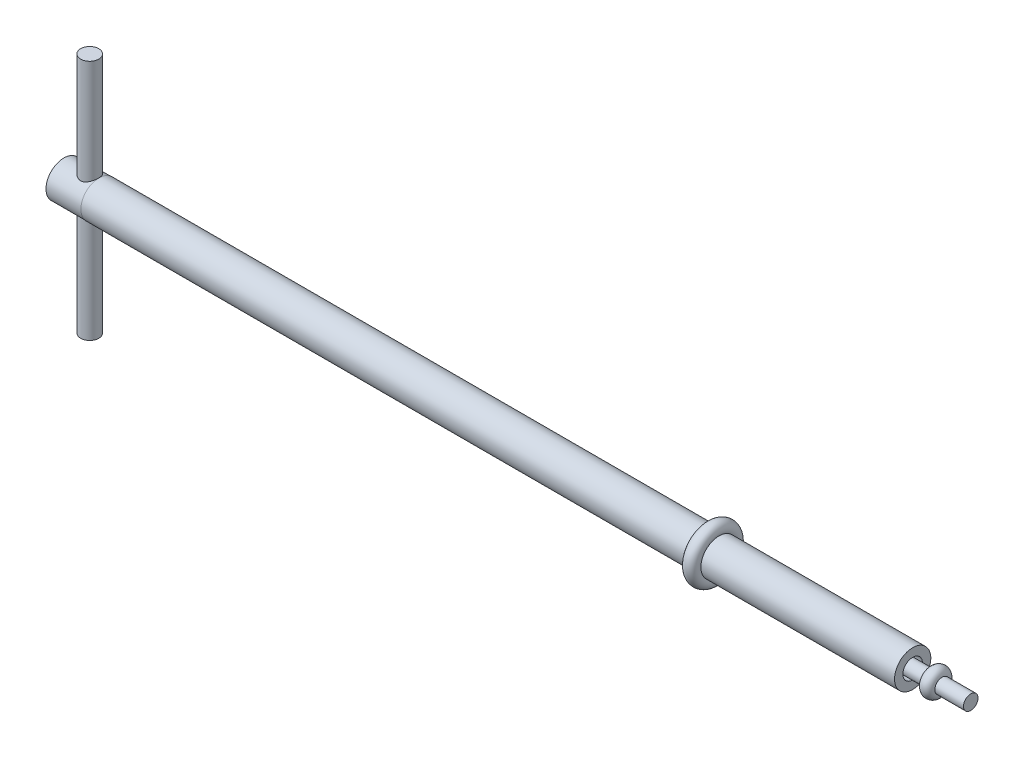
ISO-10303-21;
HEADER;
FILE_DESCRIPTION(('STEP AP214'),'2;1');
FILE_NAME('part.step','',(''),(''),'','','');
FILE_SCHEMA(('AUTOMOTIVE_DESIGN { 1 0 10303 214 1 1 1 1 }'));
ENDSEC;
DATA;
#1=APPLICATION_CONTEXT('core data for automotive mechanical design processes');
#2=APPLICATION_PROTOCOL_DEFINITION('international standard','automotive_design',2000,#1);
#3=PRODUCT_CONTEXT('',#1,'mechanical');
#4=PRODUCT('Part','Part','',(#3));
#5=PRODUCT_RELATED_PRODUCT_CATEGORY('part','',(#4));
#6=PRODUCT_DEFINITION_FORMATION('','',#4);
#7=PRODUCT_DEFINITION_CONTEXT('part definition',#1,'design');
#8=PRODUCT_DEFINITION('design','',#6,#7);
#9=PRODUCT_DEFINITION_SHAPE('','',#8);
#10=(LENGTH_UNIT() NAMED_UNIT(*) SI_UNIT(.MILLI.,.METRE.));
#11=(NAMED_UNIT(*) PLANE_ANGLE_UNIT() SI_UNIT($,.RADIAN.));
#12=(NAMED_UNIT(*) SI_UNIT($,.STERADIAN.) SOLID_ANGLE_UNIT());
#13=UNCERTAINTY_MEASURE_WITH_UNIT(LENGTH_MEASURE(1.E-05),#10,'distance_accuracy_value','');
#14=(GEOMETRIC_REPRESENTATION_CONTEXT(3) GLOBAL_UNCERTAINTY_ASSIGNED_CONTEXT((#13)) GLOBAL_UNIT_ASSIGNED_CONTEXT((#10,
#11,#12)) REPRESENTATION_CONTEXT('',''));
#15=CARTESIAN_POINT('',(0.,0.,0.));
#16=DIRECTION('',(0.,0.,1.));
#17=DIRECTION('',(1.,0.,0.));
#18=AXIS2_PLACEMENT_3D('',#15,#16,#17);
#19=CARTESIAN_POINT('',(0.,0.,0.));
#20=DIRECTION('',(1.,0.,0.));
#21=DIRECTION('',(0.,0.,-1.));
#22=AXIS2_PLACEMENT_3D('',#19,#20,#21);
#23=PLANE('',#22);
#24=CARTESIAN_POINT('',(0.,0.,0.));
#25=DIRECTION('',(-1.,0.,0.));
#26=DIRECTION('',(0.,0.,1.));
#27=AXIS2_PLACEMENT_3D('',#24,#25,#26);
#28=CIRCLE('',#27,2.96848884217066);
#29=CARTESIAN_POINT('',(0.,0.,2.96848884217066));
#30=VERTEX_POINT('',#29);
#31=EDGE_CURVE('E9',#30,#30,#28,.T.);
#32=ORIENTED_EDGE('',*,*,#31,.T.);
#33=EDGE_LOOP('',(#32));
#34=FACE_BOUND('',#33,.T.);
#35=ADVANCED_FACE('F14',(#34),#23,.F.);
#36=CARTESIAN_POINT('',(0.,0.,0.));
#37=DIRECTION('',(-1.,0.,0.));
#38=DIRECTION('',(0.,0.,1.));
#39=AXIS2_PLACEMENT_3D('',#36,#37,#38);
#40=CYLINDRICAL_SURFACE('',#39,2.96848884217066);
#41=CARTESIAN_POINT('',(4.2661907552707,-2.56162565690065,1.5));
#42=CARTESIAN_POINT('',(4.34422264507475,-2.56163267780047,1.4999944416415));
#43=CARTESIAN_POINT('',(4.42235011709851,-2.5652455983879,1.49387019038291));
#44=CARTESIAN_POINT('',(4.57619660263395,-2.57917019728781,1.46969018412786));
#45=CARTESIAN_POINT('',(4.65191032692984,-2.58949565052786,1.45160989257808));
#46=CARTESIAN_POINT('',(4.7984121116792,-2.61534051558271,1.40450365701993));
#47=CARTESIAN_POINT('',(4.86922439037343,-2.63083180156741,1.37553687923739));
#48=CARTESIAN_POINT('',(5.00496574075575,-2.66521903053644,1.3076607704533));
#49=CARTESIAN_POINT('',(5.06989438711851,-2.68411521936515,1.26875072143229));
#50=CARTESIAN_POINT('',(5.1980701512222,-2.72512943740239,1.17824574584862));
#51=CARTESIAN_POINT('',(5.26071360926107,-2.74738478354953,1.12585775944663));
#52=CARTESIAN_POINT('',(5.37679616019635,-2.79150219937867,1.01153200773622));
#53=CARTESIAN_POINT('',(5.43023057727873,-2.81336406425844,0.949589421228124));
#54=CARTESIAN_POINT('',(5.53000027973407,-2.85604040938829,0.812675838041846));
#55=CARTESIAN_POINT('',(5.57558830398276,-2.87667768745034,0.737099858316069));
#56=CARTESIAN_POINT('',(5.65312694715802,-2.91278858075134,0.57811281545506));
#57=CARTESIAN_POINT('',(5.68508635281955,-2.92826552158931,0.494706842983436));
#58=CARTESIAN_POINT('',(5.73205409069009,-2.95132082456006,0.328826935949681));
#59=CARTESIAN_POINT('',(5.74812234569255,-2.95939000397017,0.246722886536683));
#60=CARTESIAN_POINT('',(5.76634693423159,-2.96855664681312,0.0806187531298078));
#61=CARTESIAN_POINT('',(5.76851189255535,-2.96965843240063,-0.00338012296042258));
#62=CARTESIAN_POINT('',(5.75926674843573,-2.96499461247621,-0.162900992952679));
#63=CARTESIAN_POINT('',(5.74904466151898,-2.95982995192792,-0.238513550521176));
#64=CARTESIAN_POINT('',(5.71744812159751,-2.94412744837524,-0.386779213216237));
#65=CARTESIAN_POINT('',(5.69607283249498,-2.93358920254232,-0.459432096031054));
#66=CARTESIAN_POINT('',(5.64265046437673,-2.90792243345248,-0.600967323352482));
#67=CARTESIAN_POINT('',(5.6104622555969,-2.89273345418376,-0.669784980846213));
#68=CARTESIAN_POINT('',(5.53652935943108,-2.85912624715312,-0.801205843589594));
#69=CARTESIAN_POINT('',(5.49478127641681,-2.84070687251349,-0.863806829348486));
#70=CARTESIAN_POINT('',(5.39831355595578,-2.80027310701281,-0.987431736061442));
#71=CARTESIAN_POINT('',(5.34273339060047,-2.77808334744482,-1.04772730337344));
#72=CARTESIAN_POINT('',(5.22247589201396,-2.73373058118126,-1.15853905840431));
#73=CARTESIAN_POINT('',(5.15779137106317,-2.711567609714,-1.20904744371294));
#74=CARTESIAN_POINT('',(5.01595350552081,-2.66818702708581,-1.30211863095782));
#75=CARTESIAN_POINT('',(4.93825943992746,-2.64712790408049,-1.34393869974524));
#76=CARTESIAN_POINT('',(4.77563373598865,-2.61059724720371,-1.41360191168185));
#77=CARTESIAN_POINT('',(4.69070988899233,-2.59511979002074,-1.44145988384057));
#78=CARTESIAN_POINT('',(4.52314660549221,-2.5732516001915,-1.48012245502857));
#79=CARTESIAN_POINT('',(4.44086504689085,-2.5662346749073,-1.4921098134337));
#80=CARTESIAN_POINT('',(4.27518725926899,-2.56030791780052,-1.50226241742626));
#81=CARTESIAN_POINT('',(4.19179190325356,-2.56139207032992,-1.50043791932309));
#82=CARTESIAN_POINT('',(4.0363004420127,-2.57088003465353,-1.48410429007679));
#83=CARTESIAN_POINT('',(3.96399155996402,-2.57844372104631,-1.47105036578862));
#84=CARTESIAN_POINT('',(3.82273455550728,-2.5987858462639,-1.43480545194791));
#85=CARTESIAN_POINT('',(3.75378756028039,-2.61156602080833,-1.4116110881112));
#86=CARTESIAN_POINT('',(3.61758262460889,-2.64158935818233,-1.35462537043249));
#87=CARTESIAN_POINT('',(3.55054962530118,-2.65901132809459,-1.32039421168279));
#88=CARTESIAN_POINT('',(3.4227891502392,-2.69620279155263,-1.24268708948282));
#89=CARTESIAN_POINT('',(3.36206494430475,-2.71597349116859,-1.19920636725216));
#90=CARTESIAN_POINT('',(3.24042974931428,-2.75870627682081,-1.09766735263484));
#91=CARTESIAN_POINT('',(3.18050972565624,-2.78175048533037,-1.03845113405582));
#92=CARTESIAN_POINT('',(3.07113715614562,-2.82623083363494,-0.910458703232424));
#93=CARTESIAN_POINT('',(3.02168838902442,-2.84766639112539,-0.841679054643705));
#94=CARTESIAN_POINT('',(2.93345142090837,-2.88730330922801,-0.693843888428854));
#95=CARTESIAN_POINT('',(2.89500808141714,-2.90539479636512,-0.61455096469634));
#96=CARTESIAN_POINT('',(2.83239387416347,-2.93546253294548,-0.449446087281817));
#97=CARTESIAN_POINT('',(2.80821021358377,-2.94744426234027,-0.363640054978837));
#98=CARTESIAN_POINT('',(2.77692709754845,-2.96305064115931,-0.196555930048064));
#99=CARTESIAN_POINT('',(2.76844828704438,-2.96734871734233,-0.115598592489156));
#100=CARTESIAN_POINT('',(2.76472481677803,-2.96922900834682,0.046686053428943));
#101=CARTESIAN_POINT('',(2.76947531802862,-2.96681367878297,0.128013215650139));
#102=CARTESIAN_POINT('',(2.79117351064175,-2.95593044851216,0.282881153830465));
#103=CARTESIAN_POINT('',(2.80726716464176,-2.94788661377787,0.356574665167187));
#104=CARTESIAN_POINT('',(2.8500269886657,-2.92696073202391,0.500089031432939));
#105=CARTESIAN_POINT('',(2.87669464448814,-2.91407800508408,0.569909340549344));
#106=CARTESIAN_POINT('',(2.94100554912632,-2.88395591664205,0.70700699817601));
#107=CARTESIAN_POINT('',(2.97906392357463,-2.86655585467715,0.774053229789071));
#108=CARTESIAN_POINT('',(3.06455784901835,-2.82919949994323,0.901081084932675));
#109=CARTESIAN_POINT('',(3.11199768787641,-2.80924203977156,0.961059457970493));
#110=CARTESIAN_POINT('',(3.2204757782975,-2.76635443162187,1.0786621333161));
#111=CARTESIAN_POINT('',(3.28240495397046,-2.74332800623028,1.13543169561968));
#112=CARTESIAN_POINT('',(3.41521608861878,-2.69855126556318,1.23810027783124));
#113=CARTESIAN_POINT('',(3.48610617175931,-2.67680213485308,1.28398932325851));
#114=CARTESIAN_POINT('',(3.63807370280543,-2.63645767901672,1.36496837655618));
#115=CARTESIAN_POINT('',(3.71942032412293,-2.61799889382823,1.39962566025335));
#116=CARTESIAN_POINT('',(3.88798624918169,-2.5880823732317,1.45421765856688));
#117=CARTESIAN_POINT('',(3.97518486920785,-2.57660128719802,1.47420152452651));
#118=CARTESIAN_POINT('',(4.09717142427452,-2.56697512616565,1.49083314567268));
#119=CARTESIAN_POINT('',(4.13084530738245,-2.56497652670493,1.49426512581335));
#120=CARTESIAN_POINT('',(4.1984036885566,-2.56230022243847,1.49884983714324));
#121=CARTESIAN_POINT('',(4.23228820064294,-2.56162260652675,1.50000241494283));
#122=CARTESIAN_POINT('',(4.2661907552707,-2.56162565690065,1.5));
#123=B_SPLINE_CURVE_WITH_KNOTS('',3,(#41,#42,#43,#44,#45,#46,#47,#48,#49,#50,#51,#52,#53,#54,
#55,#56,#57,#58,#59,#60,#61,#62,#63,#64,#65,#66,#67,#68,#69,#70,#71,#72,#73,#74,#75,#76,#77,#78,
#79,#80,#81,#82,#83,#84,#85,#86,#87,#88,#89,#90,#91,#92,#93,#94,#95,#96,#97,#98,#99,#100,#101,
#102,#103,#104,#105,#106,#107,#108,#109,#110,#111,#112,#113,#114,#115,#116,#117,#118,#119,#120,
#121,#122),.UNSPECIFIED.,.T.,.F.,(4,2,2,2,2,2,2,2,2,2,2,2,2,2,2,2,2,2,2,2,2,2,2,2,2,2,2,2,2,2,2,
2,2,2,2,2,2,2,2,2,4),(0.,0.233952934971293,0.468387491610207,0.701565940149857,
0.934761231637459,1.18762397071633,1.44061472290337,1.71111458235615,1.98143977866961,
2.2321892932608,2.48278324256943,2.71113163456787,2.93949714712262,3.17096723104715,
3.40251966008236,3.65630154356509,3.91028491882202,4.18100181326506,4.45143056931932,
4.70029410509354,4.94897285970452,5.16957851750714,5.39025763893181,5.62112511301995,
5.85211165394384,6.11296325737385,6.37390883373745,6.64230820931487,6.91046642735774,
7.15369256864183,7.39682975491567,7.62338321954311,7.84996852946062,8.08610136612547,
8.32234237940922,8.58252752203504,8.8429502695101,9.1124607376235,9.38106425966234,
9.48270307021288,9.58434872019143),.UNSPECIFIED.);
#124=CARTESIAN_POINT('',(4.2661907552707,-2.56162565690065,1.5));
#125=VERTEX_POINT('',#124);
#126=EDGE_CURVE('E17',#125,#125,#123,.T.);
#127=ORIENTED_EDGE('',*,*,#126,.T.);
#128=EDGE_LOOP('',(#127));
#129=FACE_BOUND('',#128,.T.);
#130=CARTESIAN_POINT('',(4.2661907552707,2.56162565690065,1.5));
#131=CARTESIAN_POINT('',(4.18815886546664,2.56163267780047,1.4999944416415));
#132=CARTESIAN_POINT('',(4.11003139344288,2.5652455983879,1.49387019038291));
#133=CARTESIAN_POINT('',(3.95618490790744,2.57917019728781,1.46969018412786));
#134=CARTESIAN_POINT('',(3.88047118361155,2.58949565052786,1.45160989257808));
#135=CARTESIAN_POINT('',(3.73396939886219,2.61534051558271,1.40450365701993));
#136=CARTESIAN_POINT('',(3.66315712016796,2.63083180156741,1.37553687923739));
#137=CARTESIAN_POINT('',(3.52741576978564,2.66521903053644,1.3076607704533));
#138=CARTESIAN_POINT('',(3.46248712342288,2.68411521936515,1.26875072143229));
#139=CARTESIAN_POINT('',(3.33431135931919,2.72512943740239,1.17824574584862));
#140=CARTESIAN_POINT('',(3.27166790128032,2.74738478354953,1.12585775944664));
#141=CARTESIAN_POINT('',(3.15558535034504,2.79150219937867,1.01153200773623));
#142=CARTESIAN_POINT('',(3.10215093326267,2.81336406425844,0.949589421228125));
#143=CARTESIAN_POINT('',(3.00238123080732,2.85604040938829,0.812675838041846));
#144=CARTESIAN_POINT('',(2.95679320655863,2.87667768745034,0.73709985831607));
#145=CARTESIAN_POINT('',(2.87925456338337,2.91278858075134,0.578112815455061));
#146=CARTESIAN_POINT('',(2.84729515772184,2.92826552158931,0.494706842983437));
#147=CARTESIAN_POINT('',(2.8003274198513,2.95132082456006,0.328826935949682));
#148=CARTESIAN_POINT('',(2.78425916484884,2.95939000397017,0.246722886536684));
#149=CARTESIAN_POINT('',(2.7660345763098,2.96855664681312,0.0806187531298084));
#150=CARTESIAN_POINT('',(2.76386961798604,2.96965843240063,-0.00338012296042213));
#151=CARTESIAN_POINT('',(2.77311476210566,2.96499461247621,-0.162900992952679));
#152=CARTESIAN_POINT('',(2.78333684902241,2.95982995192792,-0.238513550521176));
#153=CARTESIAN_POINT('',(2.81493338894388,2.94412744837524,-0.386779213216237));
#154=CARTESIAN_POINT('',(2.83630867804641,2.93358920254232,-0.459432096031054));
#155=CARTESIAN_POINT('',(2.88973104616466,2.90792243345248,-0.600967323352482));
#156=CARTESIAN_POINT('',(2.92191925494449,2.89273345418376,-0.669784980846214));
#157=CARTESIAN_POINT('',(2.99585215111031,2.85912624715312,-0.801205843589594));
#158=CARTESIAN_POINT('',(3.03760023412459,2.84070687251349,-0.863806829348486));
#159=CARTESIAN_POINT('',(3.13406795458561,2.80027310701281,-0.987431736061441));
#160=CARTESIAN_POINT('',(3.18964811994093,2.77808334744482,-1.04772730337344));
#161=CARTESIAN_POINT('',(3.30990561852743,2.73373058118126,-1.15853905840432));
#162=CARTESIAN_POINT('',(3.37459013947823,2.711567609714,-1.20904744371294));
#163=CARTESIAN_POINT('',(3.51642800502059,2.66818702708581,-1.30211863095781));
#164=CARTESIAN_POINT('',(3.59412207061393,2.64712790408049,-1.34393869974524));
#165=CARTESIAN_POINT('',(3.75674777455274,2.6105972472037,-1.41360191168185));
#166=CARTESIAN_POINT('',(3.84167162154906,2.59511979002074,-1.44145988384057));
#167=CARTESIAN_POINT('',(4.00923490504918,2.5732516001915,-1.48012245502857));
#168=CARTESIAN_POINT('',(4.09151646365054,2.5662346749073,-1.4921098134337));
#169=CARTESIAN_POINT('',(4.2571942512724,2.56030791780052,-1.50226241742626));
#170=CARTESIAN_POINT('',(4.34058960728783,2.56139207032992,-1.50043791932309));
#171=CARTESIAN_POINT('',(4.49608106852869,2.57088003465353,-1.48410429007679));
#172=CARTESIAN_POINT('',(4.56838995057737,2.57844372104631,-1.47105036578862));
#173=CARTESIAN_POINT('',(4.70964695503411,2.59878584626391,-1.43480545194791));
#174=CARTESIAN_POINT('',(4.77859395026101,2.61156602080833,-1.4116110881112));
#175=CARTESIAN_POINT('',(4.9147988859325,2.64158935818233,-1.35462537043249));
#176=CARTESIAN_POINT('',(4.98183188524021,2.65901132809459,-1.32039421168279));
#177=CARTESIAN_POINT('',(5.10959236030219,2.69620279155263,-1.24268708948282));
#178=CARTESIAN_POINT('',(5.17031656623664,2.71597349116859,-1.19920636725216));
#179=CARTESIAN_POINT('',(5.29195176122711,2.75870627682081,-1.09766735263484));
#180=CARTESIAN_POINT('',(5.35187178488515,2.78175048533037,-1.03845113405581));
#181=CARTESIAN_POINT('',(5.46124435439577,2.82623083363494,-0.910458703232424));
#182=CARTESIAN_POINT('',(5.51069312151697,2.84766639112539,-0.841679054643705));
#183=CARTESIAN_POINT('',(5.59893008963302,2.88730330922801,-0.693843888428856));
#184=CARTESIAN_POINT('',(5.63737342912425,2.90539479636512,-0.614550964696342));
#185=CARTESIAN_POINT('',(5.69998763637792,2.93546253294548,-0.449446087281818));
#186=CARTESIAN_POINT('',(5.72417129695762,2.94744426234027,-0.363640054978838));
#187=CARTESIAN_POINT('',(5.75545441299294,2.96305064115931,-0.196555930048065));
#188=CARTESIAN_POINT('',(5.76393322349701,2.96734871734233,-0.115598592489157));
#189=CARTESIAN_POINT('',(5.76765669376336,2.96922900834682,0.0466860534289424));
#190=CARTESIAN_POINT('',(5.76290619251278,2.96681367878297,0.128013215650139));
#191=CARTESIAN_POINT('',(5.74120799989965,2.95593044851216,0.282881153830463));
#192=CARTESIAN_POINT('',(5.72511434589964,2.94788661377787,0.356574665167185));
#193=CARTESIAN_POINT('',(5.68235452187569,2.92696073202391,0.500089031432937));
#194=CARTESIAN_POINT('',(5.65568686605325,2.91407800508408,0.569909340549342));
#195=CARTESIAN_POINT('',(5.59137596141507,2.88395591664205,0.707006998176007));
#196=CARTESIAN_POINT('',(5.55331758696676,2.86655585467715,0.774053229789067));
#197=CARTESIAN_POINT('',(5.46782366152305,2.82919949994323,0.901081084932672));
#198=CARTESIAN_POINT('',(5.42038382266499,2.80924203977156,0.961059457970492));
#199=CARTESIAN_POINT('',(5.3119057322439,2.76635443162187,1.0786621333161));
#200=CARTESIAN_POINT('',(5.24997655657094,2.74332800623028,1.13543169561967));
#201=CARTESIAN_POINT('',(5.11716542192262,2.69855126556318,1.23810027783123));
#202=CARTESIAN_POINT('',(5.04627533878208,2.67680213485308,1.28398932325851));
#203=CARTESIAN_POINT('',(4.89430780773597,2.63645767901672,1.36496837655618));
#204=CARTESIAN_POINT('',(4.81296118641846,2.61799889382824,1.39962566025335));
#205=CARTESIAN_POINT('',(4.6443952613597,2.5880823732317,1.45421765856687));
#206=CARTESIAN_POINT('',(4.55719664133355,2.57660128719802,1.47420152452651));
#207=CARTESIAN_POINT('',(4.43521008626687,2.56697512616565,1.49083314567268));
#208=CARTESIAN_POINT('',(4.40153620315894,2.56497652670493,1.49426512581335));
#209=CARTESIAN_POINT('',(4.33397782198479,2.56230022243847,1.49884983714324));
#210=CARTESIAN_POINT('',(4.30009330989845,2.56162260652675,1.50000241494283));
#211=CARTESIAN_POINT('',(4.2661907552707,2.56162565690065,1.5));
#212=B_SPLINE_CURVE_WITH_KNOTS('',3,(#130,#131,#132,#133,#134,#135,#136,#137,#138,#139,#140,
#141,#142,#143,#144,#145,#146,#147,#148,#149,#150,#151,#152,#153,#154,#155,#156,#157,#158,#159,
#160,#161,#162,#163,#164,#165,#166,#167,#168,#169,#170,#171,#172,#173,#174,#175,#176,#177,#178,
#179,#180,#181,#182,#183,#184,#185,#186,#187,#188,#189,#190,#191,#192,#193,#194,#195,#196,#197,
#198,#199,#200,#201,#202,#203,#204,#205,#206,#207,#208,#209,#210,#211),.UNSPECIFIED.,.T.,.F.,(4,
2,2,2,2,2,2,2,2,2,2,2,2,2,2,2,2,2,2,2,2,2,2,2,2,2,2,2,2,2,2,2,2,2,2,2,2,2,2,2,4),(0.,
0.233952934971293,0.468387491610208,0.701565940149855,0.934761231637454,1.18762397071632,
1.44061472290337,1.71111458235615,1.98143977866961,2.2321892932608,2.48278324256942,
2.71113163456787,2.93949714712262,3.17096723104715,3.40251966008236,3.65630154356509,
3.91028491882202,4.18100181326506,4.45143056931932,4.70029410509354,4.94897285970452,
5.16957851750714,5.39025763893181,5.62112511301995,5.85211165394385,6.11296325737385,
6.37390883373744,6.64230820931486,6.91046642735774,7.15369256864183,7.39682975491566,
7.62338321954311,7.84996852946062,8.08610136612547,8.32234237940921,8.58252752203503,
8.8429502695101,9.1124607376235,9.38106425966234,9.48270307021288,9.58434872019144),.UNSPECIFIED.);
#213=CARTESIAN_POINT('',(4.2661907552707,2.56162565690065,1.5));
#214=VERTEX_POINT('',#213);
#215=EDGE_CURVE('E33',#214,#214,#212,.T.);
#216=ORIENTED_EDGE('',*,*,#215,.T.);
#217=EDGE_LOOP('',(#216));
#218=FACE_BOUND('',#217,.T.);
#219=ORIENTED_EDGE('',*,*,#31,.F.);
#220=EDGE_LOOP('',(#219));
#221=FACE_BOUND('',#220,.T.);
#222=CARTESIAN_POINT('',(5.7989899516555,0.,0.));
#223=DIRECTION('',(-1.,0.,0.));
#224=DIRECTION('',(0.,0.,1.));
#225=AXIS2_PLACEMENT_3D('',#222,#223,#224);
#226=CIRCLE('',#225,2.96848884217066);
#227=CARTESIAN_POINT('',(5.7989899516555,0.,2.96848884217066));
#228=VERTEX_POINT('',#227);
#229=EDGE_CURVE('E25',#228,#228,#226,.T.);
#230=ORIENTED_EDGE('',*,*,#229,.T.);
#231=EDGE_LOOP('',(#230));
#232=FACE_BOUND('',#231,.T.);
#233=ADVANCED_FACE('F39',(#129,#218,#221,#232),#40,.T.);
#234=CARTESIAN_POINT('',(5.7989899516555,2.96848884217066,0.));
#235=DIRECTION('',(1.,0.,0.));
#236=DIRECTION('',(0.,0.,-1.));
#237=AXIS2_PLACEMENT_3D('',#234,#235,#236);
#238=PLANE('',#237);
#239=ORIENTED_EDGE('',*,*,#229,.F.);
#240=EDGE_LOOP('',(#239));
#241=FACE_BOUND('',#240,.T.);
#242=CARTESIAN_POINT('',(5.7989899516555,0.,0.));
#243=DIRECTION('',(-1.,0.,0.));
#244=DIRECTION('',(0.,0.,1.));
#245=AXIS2_PLACEMENT_3D('',#242,#243,#244);
#246=CIRCLE('',#245,3.);
#247=CARTESIAN_POINT('',(5.7989899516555,0.,3.));
#248=VERTEX_POINT('',#247);
#249=EDGE_CURVE('E30',#248,#248,#246,.T.);
#250=ORIENTED_EDGE('',*,*,#249,.T.);
#251=EDGE_LOOP('',(#250));
#252=FACE_BOUND('',#251,.T.);
#253=ADVANCED_FACE('F91',(#241,#252),#238,.F.);
#254=CARTESIAN_POINT('',(0.,0.,0.));
#255=DIRECTION('',(-1.,0.,0.));
#256=DIRECTION('',(0.,0.,1.));
#257=AXIS2_PLACEMENT_3D('',#254,#255,#256);
#258=CYLINDRICAL_SURFACE('',#257,3.);
#259=ORIENTED_EDGE('',*,*,#249,.F.);
#260=EDGE_LOOP('',(#259));
#261=FACE_BOUND('',#260,.T.);
#262=CARTESIAN_POINT('',(106.327394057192,0.,0.));
#263=DIRECTION('',(-1.,0.,0.));
#264=DIRECTION('',(0.,0.,1.));
#265=AXIS2_PLACEMENT_3D('',#262,#263,#264);
#266=CIRCLE('',#265,3.);
#267=CARTESIAN_POINT('',(106.327394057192,0.,3.));
#268=VERTEX_POINT('',#267);
#269=EDGE_CURVE('E246',#268,#268,#266,.T.);
#270=ORIENTED_EDGE('',*,*,#269,.T.);
#271=EDGE_LOOP('',(#270));
#272=FACE_BOUND('',#271,.T.);
#273=ADVANCED_FACE('F88',(#261,#272),#258,.T.);
#274=CARTESIAN_POINT('',(107.344067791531,0.,0.));
#275=DIRECTION('',(-1.,0.,0.));
#276=DIRECTION('',(0.,0.,1.));
#277=AXIS2_PLACEMENT_3D('',#274,#275,#276);
#278=TOROIDAL_SURFACE('',#277,3.45662602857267,1.11451012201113);
#279=ORIENTED_EDGE('',*,*,#269,.F.);
#280=EDGE_LOOP('',(#279));
#281=FACE_BOUND('',#280,.T.);
#282=CARTESIAN_POINT('',(108.36074152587,0.,0.));
#283=DIRECTION('',(-1.,0.,0.));
#284=DIRECTION('',(0.,0.,1.));
#285=AXIS2_PLACEMENT_3D('',#282,#283,#284);
#286=CIRCLE('',#285,3.);
#287=CARTESIAN_POINT('',(108.36074152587,0.,3.));
#288=VERTEX_POINT('',#287);
#289=EDGE_CURVE('E243',#288,#288,#286,.T.);
#290=ORIENTED_EDGE('',*,*,#289,.T.);
#291=EDGE_LOOP('',(#290));
#292=FACE_BOUND('',#291,.T.);
#293=ADVANCED_FACE('F84',(#281,#292),#278,.T.);
#294=CARTESIAN_POINT('',(0.,0.,0.));
#295=DIRECTION('',(-1.,0.,0.));
#296=DIRECTION('',(0.,0.,1.));
#297=AXIS2_PLACEMENT_3D('',#294,#295,#296);
#298=CYLINDRICAL_SURFACE('',#297,3.);
#299=ORIENTED_EDGE('',*,*,#289,.F.);
#300=EDGE_LOOP('',(#299));
#301=FACE_BOUND('',#300,.T.);
#302=CARTESIAN_POINT('',(140.390499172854,0.,0.));
#303=DIRECTION('',(-1.,0.,0.));
#304=DIRECTION('',(0.,0.,1.));
#305=AXIS2_PLACEMENT_3D('',#302,#303,#304);
#306=CIRCLE('',#305,3.);
#307=CARTESIAN_POINT('',(140.390499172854,0.,3.));
#308=VERTEX_POINT('',#307);
#309=EDGE_CURVE('E240',#308,#308,#306,.T.);
#310=ORIENTED_EDGE('',*,*,#309,.T.);
#311=EDGE_LOOP('',(#310));
#312=FACE_BOUND('',#311,.T.);
#313=ADVANCED_FACE('F80',(#301,#312),#298,.T.);
#314=CARTESIAN_POINT('',(140.390499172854,3.,0.));
#315=DIRECTION('',(-1.,0.,0.));
#316=DIRECTION('',(0.,0.,1.));
#317=AXIS2_PLACEMENT_3D('',#314,#315,#316);
#318=PLANE('',#317);
#319=ORIENTED_EDGE('',*,*,#309,.F.);
#320=EDGE_LOOP('',(#319));
#321=FACE_BOUND('',#320,.T.);
#322=CARTESIAN_POINT('',(140.390499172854,0.,0.));
#323=DIRECTION('',(-1.,0.,0.));
#324=DIRECTION('',(0.,0.,1.));
#325=AXIS2_PLACEMENT_3D('',#322,#323,#324);
#326=CIRCLE('',#325,1.62012250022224);
#327=CARTESIAN_POINT('',(140.390499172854,0.,1.62012250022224));
#328=VERTEX_POINT('',#327);
#329=EDGE_CURVE('E237',#328,#328,#326,.T.);
#330=ORIENTED_EDGE('',*,*,#329,.T.);
#331=EDGE_LOOP('',(#330));
#332=FACE_BOUND('',#331,.T.);
#333=ADVANCED_FACE('F76',(#321,#332),#318,.F.);
#334=CARTESIAN_POINT('',(0.,0.,0.));
#335=DIRECTION('',(-1.,0.,0.));
#336=DIRECTION('',(0.,0.,1.));
#337=AXIS2_PLACEMENT_3D('',#334,#335,#336);
#338=CYLINDRICAL_SURFACE('',#337,1.62012250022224);
#339=ORIENTED_EDGE('',*,*,#329,.F.);
#340=EDGE_LOOP('',(#339));
#341=FACE_BOUND('',#340,.T.);
#342=CARTESIAN_POINT('',(135.391137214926,0.,0.));
#343=DIRECTION('',(-1.,0.,0.));
#344=DIRECTION('',(0.,0.,1.));
#345=AXIS2_PLACEMENT_3D('',#342,#343,#344);
#346=CIRCLE('',#345,1.62012250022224);
#347=CARTESIAN_POINT('',(135.391137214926,0.,1.62012250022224));
#348=VERTEX_POINT('',#347);
#349=EDGE_CURVE('E234',#348,#348,#346,.T.);
#350=ORIENTED_EDGE('',*,*,#349,.T.);
#351=EDGE_LOOP('',(#350));
#352=FACE_BOUND('',#351,.T.);
#353=ADVANCED_FACE('F72',(#341,#352),#338,.F.);
#354=CARTESIAN_POINT('',(135.391137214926,1.62012250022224,0.));
#355=DIRECTION('',(-1.,0.,0.));
#356=DIRECTION('',(0.,0.,1.));
#357=AXIS2_PLACEMENT_3D('',#354,#355,#356);
#358=PLANE('',#357);
#359=ORIENTED_EDGE('',*,*,#349,.F.);
#360=EDGE_LOOP('',(#359));
#361=FACE_BOUND('',#360,.T.);
#362=CARTESIAN_POINT('',(135.391137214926,0.,0.));
#363=DIRECTION('',(-1.,0.,0.));
#364=DIRECTION('',(0.,0.,1.));
#365=AXIS2_PLACEMENT_3D('',#362,#363,#364);
#366=CIRCLE('',#365,1.20000172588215);
#367=CARTESIAN_POINT('',(135.391137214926,0.,1.20000172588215));
#368=VERTEX_POINT('',#367);
#369=EDGE_CURVE('E231',#368,#368,#366,.T.);
#370=ORIENTED_EDGE('',*,*,#369,.T.);
#371=EDGE_LOOP('',(#370));
#372=FACE_BOUND('',#371,.T.);
#373=ADVANCED_FACE('F68',(#361,#372),#358,.F.);
#374=CARTESIAN_POINT('',(0.,0.,0.));
#375=DIRECTION('',(-1.,0.,0.));
#376=DIRECTION('',(0.,0.,1.));
#377=AXIS2_PLACEMENT_3D('',#374,#375,#376);
#378=CYLINDRICAL_SURFACE('',#377,1.20000172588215);
#379=ORIENTED_EDGE('',*,*,#369,.F.);
#380=EDGE_LOOP('',(#379));
#381=FACE_BOUND('',#380,.T.);
#382=CARTESIAN_POINT('',(143.146220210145,0.,0.));
#383=DIRECTION('',(-1.,0.,0.));
#384=DIRECTION('',(0.,0.,1.));
#385=AXIS2_PLACEMENT_3D('',#382,#383,#384);
#386=CIRCLE('',#385,1.20000172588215);
#387=CARTESIAN_POINT('',(143.146220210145,0.,1.20000172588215));
#388=VERTEX_POINT('',#387);
#389=EDGE_CURVE('E228',#388,#388,#386,.T.);
#390=ORIENTED_EDGE('',*,*,#389,.T.);
#391=EDGE_LOOP('',(#390));
#392=FACE_BOUND('',#391,.T.);
#393=ADVANCED_FACE('F64',(#381,#392),#378,.T.);
#394=CARTESIAN_POINT('',(144.201753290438,0.,0.));
#395=DIRECTION('',(-1.,0.,0.));
#396=DIRECTION('',(0.,0.,1.));
#397=AXIS2_PLACEMENT_3D('',#394,#395,#396);
#398=TOROIDAL_SURFACE('',#397,1.20000172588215,1.05553308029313);
#399=ORIENTED_EDGE('',*,*,#389,.F.);
#400=EDGE_LOOP('',(#399));
#401=FACE_BOUND('',#400,.T.);
#402=CARTESIAN_POINT('',(145.257286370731,0.,0.));
#403=DIRECTION('',(-1.,0.,0.));
#404=DIRECTION('',(0.,0.,1.));
#405=AXIS2_PLACEMENT_3D('',#402,#403,#404);
#406=CIRCLE('',#405,1.20000172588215);
#407=CARTESIAN_POINT('',(145.257286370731,0.,1.20000172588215));
#408=VERTEX_POINT('',#407);
#409=EDGE_CURVE('E225',#408,#408,#406,.T.);
#410=ORIENTED_EDGE('',*,*,#409,.T.);
#411=EDGE_LOOP('',(#410));
#412=FACE_BOUND('',#411,.T.);
#413=ADVANCED_FACE('F60',(#401,#412),#398,.T.);
#414=CARTESIAN_POINT('',(0.,0.,0.));
#415=DIRECTION('',(-1.,0.,0.));
#416=DIRECTION('',(0.,0.,1.));
#417=AXIS2_PLACEMENT_3D('',#414,#415,#416);
#418=CYLINDRICAL_SURFACE('',#417,1.20000172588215);
#419=ORIENTED_EDGE('',*,*,#409,.F.);
#420=EDGE_LOOP('',(#419));
#421=FACE_BOUND('',#420,.T.);
#422=CARTESIAN_POINT('',(150.,0.,0.));
#423=DIRECTION('',(-1.,0.,0.));
#424=DIRECTION('',(0.,0.,1.));
#425=AXIS2_PLACEMENT_3D('',#422,#423,#424);
#426=CIRCLE('',#425,1.20000172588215);
#427=CARTESIAN_POINT('',(150.,0.,1.20000172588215));
#428=VERTEX_POINT('',#427);
#429=EDGE_CURVE('E222',#428,#428,#426,.T.);
#430=ORIENTED_EDGE('',*,*,#429,.T.);
#431=EDGE_LOOP('',(#430));
#432=FACE_BOUND('',#431,.T.);
#433=ADVANCED_FACE('F56',(#421,#432),#418,.T.);
#434=CARTESIAN_POINT('',(150.,1.20000172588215,0.));
#435=DIRECTION('',(-1.,0.,0.));
#436=DIRECTION('',(0.,0.,1.));
#437=AXIS2_PLACEMENT_3D('',#434,#435,#436);
#438=PLANE('',#437);
#439=ORIENTED_EDGE('',*,*,#429,.F.);
#440=EDGE_LOOP('',(#439));
#441=FACE_BOUND('',#440,.T.);
#442=ADVANCED_FACE('F51',(#441),#438,.F.);
#443=CARTESIAN_POINT('',(4.2661907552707,20.,0.));
#444=DIRECTION('',(0.,1.,0.));
#445=DIRECTION('',(0.,0.,1.));
#446=AXIS2_PLACEMENT_3D('',#443,#444,#445);
#447=PLANE('',#446);
#448=CARTESIAN_POINT('',(4.2661907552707,20.,0.));
#449=DIRECTION('',(0.,1.,0.));
#450=DIRECTION('',(0.,0.,1.));
#451=AXIS2_PLACEMENT_3D('',#448,#449,#450);
#452=CIRCLE('',#451,1.5);
#453=CARTESIAN_POINT('',(4.2661907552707,20.,1.5));
#454=VERTEX_POINT('',#453);
#455=EDGE_CURVE('E217',#454,#454,#452,.T.);
#456=ORIENTED_EDGE('',*,*,#455,.T.);
#457=EDGE_LOOP('',(#456));
#458=FACE_BOUND('',#457,.T.);
#459=ADVANCED_FACE('F55',(#458),#447,.T.);
#460=CARTESIAN_POINT('',(4.2661907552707,-20.,0.));
#461=DIRECTION('',(0.,1.,0.));
#462=DIRECTION('',(0.,0.,1.));
#463=AXIS2_PLACEMENT_3D('',#460,#461,#462);
#464=CYLINDRICAL_SURFACE('',#463,1.5);
#465=ORIENTED_EDGE('',*,*,#455,.F.);
#466=EDGE_LOOP('',(#465));
#467=FACE_BOUND('',#466,.T.);
#468=ORIENTED_EDGE('',*,*,#215,.F.);
#469=EDGE_LOOP('',(#468));
#470=FACE_BOUND('',#469,.T.);
#471=ADVANCED_FACE('F48',(#467,#470),#464,.T.);
#472=CARTESIAN_POINT('',(4.2661907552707,-20.,0.));
#473=DIRECTION('',(0.,1.,0.));
#474=DIRECTION('',(0.,0.,1.));
#475=AXIS2_PLACEMENT_3D('',#472,#473,#474);
#476=CIRCLE('',#475,1.5);
#477=CARTESIAN_POINT('',(4.2661907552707,-20.,1.5));
#478=VERTEX_POINT('',#477);
#479=EDGE_CURVE('E38',#478,#478,#476,.T.);
#480=ORIENTED_EDGE('',*,*,#479,.T.);
#481=EDGE_LOOP('',(#480));
#482=FACE_BOUND('',#481,.T.);
#483=ORIENTED_EDGE('',*,*,#126,.F.);
#484=EDGE_LOOP('',(#483));
#485=FACE_BOUND('',#484,.T.);
#486=ADVANCED_FACE('F42',(#482,#485),#464,.T.);
#487=CARTESIAN_POINT('',(4.2661907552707,-20.,0.));
#488=DIRECTION('',(0.,1.,0.));
#489=DIRECTION('',(0.,0.,1.));
#490=AXIS2_PLACEMENT_3D('',#487,#488,#489);
#491=PLANE('',#490);
#492=ORIENTED_EDGE('',*,*,#479,.F.);
#493=EDGE_LOOP('',(#492));
#494=FACE_BOUND('',#493,.T.);
#495=ADVANCED_FACE('F47',(#494),#491,.F.);
#496=CLOSED_SHELL('',(#35,#233,#253,#273,#293,#313,#333,#353,#373,#393,#413,#433,#442,#459,#471,
#486,#495));
#497=MANIFOLD_SOLID_BREP('B1',#496);
#498=ADVANCED_BREP_SHAPE_REPRESENTATION('',(#18,#497),#14);
#499=SHAPE_DEFINITION_REPRESENTATION(#9,#498);
ENDSEC;
END-ISO-10303-21;
